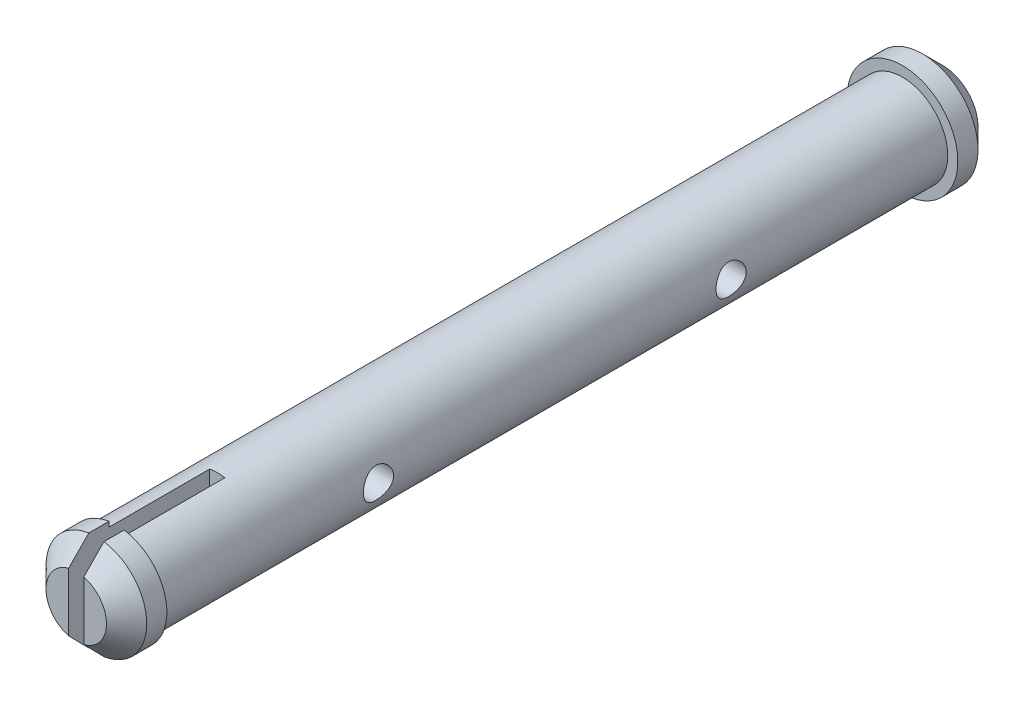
ISO-10303-21;
HEADER;
FILE_DESCRIPTION(('STEP AP214'),'2;1');
FILE_NAME('part.step','',(''),(''),'','','');
FILE_SCHEMA(('AUTOMOTIVE_DESIGN { 1 0 10303 214 1 1 1 1 }'));
ENDSEC;
DATA;
#1=APPLICATION_CONTEXT('core data for automotive mechanical design processes');
#2=APPLICATION_PROTOCOL_DEFINITION('international standard','automotive_design',2000,#1);
#3=PRODUCT_CONTEXT('',#1,'mechanical');
#4=PRODUCT('Part','Part','',(#3));
#5=PRODUCT_RELATED_PRODUCT_CATEGORY('part','',(#4));
#6=PRODUCT_DEFINITION_FORMATION('','',#4);
#7=PRODUCT_DEFINITION_CONTEXT('part definition',#1,'design');
#8=PRODUCT_DEFINITION('design','',#6,#7);
#9=PRODUCT_DEFINITION_SHAPE('','',#8);
#10=(LENGTH_UNIT() NAMED_UNIT(*) SI_UNIT(.MILLI.,.METRE.));
#11=(NAMED_UNIT(*) PLANE_ANGLE_UNIT() SI_UNIT($,.RADIAN.));
#12=(NAMED_UNIT(*) SI_UNIT($,.STERADIAN.) SOLID_ANGLE_UNIT());
#13=UNCERTAINTY_MEASURE_WITH_UNIT(LENGTH_MEASURE(1.E-05),#10,'distance_accuracy_value','');
#14=(GEOMETRIC_REPRESENTATION_CONTEXT(3) GLOBAL_UNCERTAINTY_ASSIGNED_CONTEXT((#13)) GLOBAL_UNIT_ASSIGNED_CONTEXT((#10,
#11,#12)) REPRESENTATION_CONTEXT('',''));
#15=CARTESIAN_POINT('',(0.,0.,0.));
#16=DIRECTION('',(0.,0.,1.));
#17=DIRECTION('',(1.,0.,0.));
#18=AXIS2_PLACEMENT_3D('',#15,#16,#17);
#19=CARTESIAN_POINT('',(0.,0.,82.));
#20=DIRECTION('',(0.,0.,-1.));
#21=DIRECTION('',(-1.,0.,0.));
#22=AXIS2_PLACEMENT_3D('',#19,#20,#21);
#23=CYLINDRICAL_SURFACE('',#22,5.);
#24=DIRECTION('',(0.,0.,-1.));
#25=VECTOR('',#24,1.);
#26=CARTESIAN_POINT('',(-0.749999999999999,-4.9434299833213,82.));
#27=LINE('',#26,#25);
#28=CARTESIAN_POINT('',(-0.749999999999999,-4.9434299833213,78.));
#29=VERTEX_POINT('',#28);
#30=CARTESIAN_POINT('',(-0.749999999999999,-4.9434299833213,80.));
#31=VERTEX_POINT('',#30);
#32=EDGE_CURVE('E162',#29,#31,#27,.F.);
#33=ORIENTED_EDGE('',*,*,#32,.T.);
#34=CARTESIAN_POINT('',(0.,0.,80.));
#35=DIRECTION('',(0.,0.,1.));
#36=DIRECTION('',(1.,0.,0.));
#37=AXIS2_PLACEMENT_3D('',#34,#35,#36);
#38=CIRCLE('',#37,5.);
#39=CARTESIAN_POINT('',(-0.75,4.9434299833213,80.));
#40=VERTEX_POINT('',#39);
#41=EDGE_CURVE('E316',#31,#40,#38,.F.);
#42=ORIENTED_EDGE('',*,*,#41,.T.);
#43=DIRECTION('',(0.,0.,-1.));
#44=VECTOR('',#43,1.);
#45=CARTESIAN_POINT('',(-0.75,4.9434299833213,82.));
#46=LINE('',#45,#44);
#47=CARTESIAN_POINT('',(-0.75,4.9434299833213,78.));
#48=VERTEX_POINT('',#47);
#49=EDGE_CURVE('E175',#40,#48,#46,.T.);
#50=ORIENTED_EDGE('',*,*,#49,.T.);
#51=CARTESIAN_POINT('',(0.,0.,78.));
#52=DIRECTION('',(0.,0.,1.));
#53=DIRECTION('',(1.,0.,0.));
#54=AXIS2_PLACEMENT_3D('',#51,#52,#53);
#55=CIRCLE('',#54,5.);
#56=EDGE_CURVE('E186',#48,#29,#55,.T.);
#57=ORIENTED_EDGE('',*,*,#56,.T.);
#58=EDGE_LOOP('',(#33,#42,#50,#57));
#59=FACE_BOUND('',#58,.T.);
#60=ADVANCED_FACE('F47',(#59),#23,.T.);
#61=CARTESIAN_POINT('',(0.,0.,82.));
#62=DIRECTION('',(0.,0.,1.));
#63=DIRECTION('',(1.,0.,0.));
#64=AXIS2_PLACEMENT_3D('',#61,#62,#63);
#65=PLANE('',#64);
#66=DIRECTION('',(0.,-1.,0.));
#67=VECTOR('',#66,1.);
#68=CARTESIAN_POINT('',(-0.75,5.11707389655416,82.));
#69=LINE('',#68,#67);
#70=CARTESIAN_POINT('',(-0.75,2.90473750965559,82.));
#71=VERTEX_POINT('',#70);
#72=CARTESIAN_POINT('',(-0.749999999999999,-2.90473750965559,82.));
#73=VERTEX_POINT('',#72);
#74=EDGE_CURVE('E347',#71,#73,#69,.T.);
#75=ORIENTED_EDGE('',*,*,#74,.F.);
#76=CARTESIAN_POINT('',(0.,0.,82.));
#77=DIRECTION('',(0.,0.,1.));
#78=DIRECTION('',(1.,0.,0.));
#79=AXIS2_PLACEMENT_3D('',#76,#77,#78);
#80=CIRCLE('',#79,3.00000000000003);
#81=EDGE_CURVE('E215',#71,#73,#80,.T.);
#82=ORIENTED_EDGE('',*,*,#81,.T.);
#83=EDGE_LOOP('',(#75,#82));
#84=FACE_BOUND('',#83,.T.);
#85=ADVANCED_FACE('F252',(#84),#65,.T.);
#86=CARTESIAN_POINT('',(0.,0.,78.));
#87=DIRECTION('',(0.,0.,1.));
#88=DIRECTION('',(1.,0.,0.));
#89=AXIS2_PLACEMENT_3D('',#86,#87,#88);
#90=PLANE('',#89);
#91=ORIENTED_EDGE('',*,*,#56,.F.);
#92=DIRECTION('',(0.,-1.,0.));
#93=VECTOR('',#92,1.);
#94=CARTESIAN_POINT('',(-0.749999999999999,0.,78.));
#95=LINE('',#94,#93);
#96=CARTESIAN_POINT('',(-0.75,4.43705983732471,78.));
#97=VERTEX_POINT('',#96);
#98=EDGE_CURVE('E144',#48,#97,#95,.T.);
#99=ORIENTED_EDGE('',*,*,#98,.T.);
#100=CARTESIAN_POINT('',(0.,0.,78.));
#101=DIRECTION('',(0.,0.,1.));
#102=DIRECTION('',(1.,0.,0.));
#103=AXIS2_PLACEMENT_3D('',#100,#101,#102);
#104=CIRCLE('',#103,4.5);
#105=CARTESIAN_POINT('',(-0.749999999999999,-4.43705983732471,78.));
#106=VERTEX_POINT('',#105);
#107=EDGE_CURVE('E194',#97,#106,#104,.T.);
#108=ORIENTED_EDGE('',*,*,#107,.T.);
#109=EDGE_CURVE('E203',#106,#29,#95,.T.);
#110=ORIENTED_EDGE('',*,*,#109,.T.);
#111=EDGE_LOOP('',(#91,#99,#108,#110));
#112=FACE_BOUND('',#111,.T.);
#113=ADVANCED_FACE('F256',(#112),#90,.F.);
#114=CARTESIAN_POINT('',(0.,0.,78.));
#115=DIRECTION('',(0.,0.,-1.));
#116=DIRECTION('',(-1.,0.,0.));
#117=AXIS2_PLACEMENT_3D('',#114,#115,#116);
#118=CYLINDRICAL_SURFACE('',#117,4.5);
#119=CARTESIAN_POINT('',(-4.5,0.,23.));
#120=CARTESIAN_POINT('',(-4.50000022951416,-0.0818450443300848,23.0000003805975));
#121=CARTESIAN_POINT('',(-4.49774654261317,-0.163687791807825,22.9932796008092));
#122=CARTESIAN_POINT('',(-4.48897815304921,-0.324962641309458,22.9666563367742));
#123=CARTESIAN_POINT('',(-4.48246300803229,-0.404394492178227,22.9467524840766));
#124=CARTESIAN_POINT('',(-4.46587961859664,-0.558499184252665,22.8945211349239));
#125=CARTESIAN_POINT('',(-4.4558173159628,-0.633179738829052,22.8622144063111));
#126=CARTESIAN_POINT('',(-4.43316668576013,-0.776062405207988,22.7861882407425));
#127=CARTESIAN_POINT('',(-4.42057786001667,-0.844263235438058,22.7424665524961));
#128=CARTESIAN_POINT('',(-4.39371141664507,-0.974612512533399,22.6432612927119));
#129=CARTESIAN_POINT('',(-4.37939334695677,-1.03650555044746,22.5874531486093));
#130=CARTESIAN_POINT('',(-4.35090472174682,-1.15024903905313,22.4663492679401));
#131=CARTESIAN_POINT('',(-4.33673419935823,-1.20209727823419,22.4010514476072));
#132=CARTESIAN_POINT('',(-4.30969998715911,-1.29573741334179,22.2605223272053));
#133=CARTESIAN_POINT('',(-4.29688558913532,-1.33719728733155,22.1850593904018));
#134=CARTESIAN_POINT('',(-4.27462958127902,-1.40672831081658,22.0277358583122));
#135=CARTESIAN_POINT('',(-4.26518694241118,-1.43480354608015,21.9458772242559));
#136=CARTESIAN_POINT('',(-4.25116954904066,-1.47581019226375,21.7809901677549));
#137=CARTESIAN_POINT('',(-4.24644143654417,-1.48922017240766,21.6980941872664));
#138=CARTESIAN_POINT('',(-4.24193484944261,-1.50201168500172,21.5311043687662));
#139=CARTESIAN_POINT('',(-4.24215484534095,-1.50139755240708,21.4470109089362));
#140=CARTESIAN_POINT('',(-4.2473852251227,-1.48652985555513,21.284095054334));
#141=CARTESIAN_POINT('',(-4.25217623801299,-1.47290086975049,21.2052073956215));
#142=CARTESIAN_POINT('',(-4.26564986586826,-1.43340924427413,21.0509098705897));
#143=CARTESIAN_POINT('',(-4.27433294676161,-1.40754513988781,20.9755004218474));
#144=CARTESIAN_POINT('',(-4.29476866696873,-1.34390858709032,20.8288808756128));
#145=CARTESIAN_POINT('',(-4.30656848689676,-1.30595107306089,20.7577579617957));
#146=CARTESIAN_POINT('',(-4.3318883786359,-1.21933365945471,20.6226936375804));
#147=CARTESIAN_POINT('',(-4.34540894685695,-1.17067066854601,20.5587543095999));
#148=CARTESIAN_POINT('',(-4.37350993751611,-1.06102399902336,20.4363626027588));
#149=CARTESIAN_POINT('',(-4.38810884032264,-0.999529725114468,20.3783709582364));
#150=CARTESIAN_POINT('',(-4.41610407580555,-0.867509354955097,20.2734031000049));
#151=CARTESIAN_POINT('',(-4.42950029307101,-0.796982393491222,20.2264279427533));
#152=CARTESIAN_POINT('',(-4.4537566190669,-0.647921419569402,20.1444555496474));
#153=CARTESIAN_POINT('',(-4.46459025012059,-0.569314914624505,20.1095817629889));
#154=CARTESIAN_POINT('',(-4.48230850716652,-0.406903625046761,20.0536952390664));
#155=CARTESIAN_POINT('',(-4.48919450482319,-0.32310065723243,20.0326776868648));
#156=CARTESIAN_POINT('',(-4.49801440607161,-0.156575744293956,20.0059165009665));
#157=CARTESIAN_POINT('',(-4.50015002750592,-0.0739643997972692,19.9995502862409));
#158=CARTESIAN_POINT('',(-4.49983354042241,0.0911626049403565,20.0004990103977));
#159=CARTESIAN_POINT('',(-4.49738220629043,0.173678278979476,20.0078116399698));
#160=CARTESIAN_POINT('',(-4.48830037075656,0.333779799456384,20.0354178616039));
#161=CARTESIAN_POINT('',(-4.48179298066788,0.411439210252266,20.0553293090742));
#162=CARTESIAN_POINT('',(-4.46537770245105,0.562283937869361,20.1070901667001));
#163=CARTESIAN_POINT('',(-4.45546938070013,0.63546868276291,20.1389410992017));
#164=CARTESIAN_POINT('',(-4.43293396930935,0.777432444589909,20.2146056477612));
#165=CARTESIAN_POINT('',(-4.42024222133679,0.846044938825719,20.2587118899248));
#166=CARTESIAN_POINT('',(-4.39357880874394,0.975097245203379,20.3572912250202));
#167=CARTESIAN_POINT('',(-4.37960675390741,1.03553455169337,20.4117674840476));
#168=CARTESIAN_POINT('',(-4.35115271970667,1.14937876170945,20.5324681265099));
#169=CARTESIAN_POINT('',(-4.33667641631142,1.20234145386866,20.5991138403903));
#170=CARTESIAN_POINT('',(-4.30949959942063,1.29638628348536,20.7406573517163));
#171=CARTESIAN_POINT('',(-4.29679910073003,1.33746832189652,20.8155552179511));
#172=CARTESIAN_POINT('',(-4.27473587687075,1.40639539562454,20.9715095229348));
#173=CARTESIAN_POINT('',(-4.26536641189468,1.43426719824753,21.0525531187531));
#174=CARTESIAN_POINT('',(-4.25116248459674,1.47584200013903,21.2185679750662));
#175=CARTESIAN_POINT('',(-4.24632597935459,1.48955138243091,21.3035374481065));
#176=CARTESIAN_POINT('',(-4.24196788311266,1.50191442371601,21.4702956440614));
#177=CARTESIAN_POINT('',(-4.24218600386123,1.5013053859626,21.5520235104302));
#178=CARTESIAN_POINT('',(-4.24726904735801,1.48686344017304,21.7141476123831));
#179=CARTESIAN_POINT('',(-4.25213369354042,1.47303131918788,21.7945439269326));
#180=CARTESIAN_POINT('',(-4.26576786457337,1.43305771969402,21.9502034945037));
#181=CARTESIAN_POINT('',(-4.27446147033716,1.40715501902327,22.0255352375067));
#182=CARTESIAN_POINT('',(-4.29474598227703,1.34396904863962,22.1708411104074));
#183=CARTESIAN_POINT('',(-4.3063375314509,1.30668325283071,22.240814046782));
#184=CARTESIAN_POINT('',(-4.33174243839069,1.21989103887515,22.3767255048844));
#185=CARTESIAN_POINT('',(-4.34563067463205,1.16992236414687,22.4423547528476));
#186=CARTESIAN_POINT('',(-4.37375034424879,1.05996432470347,22.5645347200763));
#187=CARTESIAN_POINT('',(-4.38798187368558,0.999972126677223,22.6210828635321));
#188=CARTESIAN_POINT('',(-4.41585045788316,0.868862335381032,22.7257166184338));
#189=CARTESIAN_POINT('',(-4.42944272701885,0.797402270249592,22.7733865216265));
#190=CARTESIAN_POINT('',(-4.45388986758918,0.647036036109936,22.855985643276));
#191=CARTESIAN_POINT('',(-4.46474543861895,0.568131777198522,22.8909181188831));
#192=CARTESIAN_POINT('',(-4.48208272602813,0.408740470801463,22.945582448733));
#193=CARTESIAN_POINT('',(-4.48873818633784,0.328481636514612,22.9659236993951));
#194=CARTESIAN_POINT('',(-4.49769610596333,0.16548062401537,22.9931304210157));
#195=CARTESIAN_POINT('',(-4.49999976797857,0.0827391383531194,22.9999996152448));
#196=CARTESIAN_POINT('',(-4.5,0.,23.));
#197=B_SPLINE_CURVE_WITH_KNOTS('',3,(#119,#120,#121,#122,#123,#124,#125,#126,#127,#128,#129,
#130,#131,#132,#133,#134,#135,#136,#137,#138,#139,#140,#141,#142,#143,#144,#145,#146,#147,#148,
#149,#150,#151,#152,#153,#154,#155,#156,#157,#158,#159,#160,#161,#162,#163,#164,#165,#166,#167,
#168,#169,#170,#171,#172,#173,#174,#175,#176,#177,#178,#179,#180,#181,#182,#183,#184,#185,#186,
#187,#188,#189,#190,#191,#192,#193,#194,#195,#196),.UNSPECIFIED.,.T.,.F.,(4,2,2,2,2,2,2,2,2,2,2,
2,2,2,2,2,2,2,2,2,2,2,2,2,2,2,2,2,2,2,2,2,2,2,2,2,2,2,4),(0.,0.245230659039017,
0.490486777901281,0.735334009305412,0.98022956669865,1.23277026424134,1.48536649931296,
1.74522577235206,2.0050056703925,2.2560288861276,2.50697450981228,2.74645239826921,
2.98595896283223,3.22932256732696,3.47275653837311,3.7288995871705,3.98506718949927,
4.24377608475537,4.50239503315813,4.74980374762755,4.99717069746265,5.2373723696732,
5.47760467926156,5.72415599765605,5.97078271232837,6.22861534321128,6.48645012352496,
6.74376020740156,7.00095427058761,7.24493499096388,7.48890119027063,7.72823380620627,
7.96761957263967,8.21745100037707,8.46735316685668,8.72699491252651,8.98657021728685,
9.23454837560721,9.4824579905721),.UNSPECIFIED.);
#198=CARTESIAN_POINT('',(-4.5,0.,23.));
#199=VERTEX_POINT('',#198);
#200=EDGE_CURVE('E53',#199,#199,#197,.T.);
#201=ORIENTED_EDGE('',*,*,#200,.T.);
#202=EDGE_LOOP('',(#201));
#203=FACE_BOUND('',#202,.T.);
#204=CARTESIAN_POINT('',(4.5,0.,20.));
#205=CARTESIAN_POINT('',(4.50000022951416,-0.0818450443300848,19.9999996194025));
#206=CARTESIAN_POINT('',(4.49774654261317,-0.163687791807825,20.0067203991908));
#207=CARTESIAN_POINT('',(4.48897815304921,-0.324962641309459,20.0333436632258));
#208=CARTESIAN_POINT('',(4.48246300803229,-0.404394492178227,20.0532475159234));
#209=CARTESIAN_POINT('',(4.46587961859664,-0.558499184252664,20.1054788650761));
#210=CARTESIAN_POINT('',(4.4558173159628,-0.633179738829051,20.1377855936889));
#211=CARTESIAN_POINT('',(4.43316668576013,-0.776062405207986,20.2138117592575));
#212=CARTESIAN_POINT('',(4.42057786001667,-0.844263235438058,20.2575334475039));
#213=CARTESIAN_POINT('',(4.39371141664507,-0.974612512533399,20.3567387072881));
#214=CARTESIAN_POINT('',(4.37939334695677,-1.03650555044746,20.4125468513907));
#215=CARTESIAN_POINT('',(4.35090472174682,-1.15024903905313,20.5336507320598));
#216=CARTESIAN_POINT('',(4.33673419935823,-1.20209727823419,20.5989485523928));
#217=CARTESIAN_POINT('',(4.30969998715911,-1.29573741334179,20.7394776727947));
#218=CARTESIAN_POINT('',(4.29688558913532,-1.33719728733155,20.8149406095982));
#219=CARTESIAN_POINT('',(4.27462958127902,-1.40672831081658,20.9722641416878));
#220=CARTESIAN_POINT('',(4.26518694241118,-1.43480354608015,21.0541227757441));
#221=CARTESIAN_POINT('',(4.25116954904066,-1.47581019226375,21.2190098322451));
#222=CARTESIAN_POINT('',(4.24644143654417,-1.48922017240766,21.3019058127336));
#223=CARTESIAN_POINT('',(4.24193484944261,-1.50201168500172,21.4688956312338));
#224=CARTESIAN_POINT('',(4.24215484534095,-1.50139755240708,21.5529890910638));
#225=CARTESIAN_POINT('',(4.2473852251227,-1.48652985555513,21.715904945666));
#226=CARTESIAN_POINT('',(4.25217623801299,-1.47290086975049,21.7947926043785));
#227=CARTESIAN_POINT('',(4.26564986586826,-1.43340924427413,21.9490901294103));
#228=CARTESIAN_POINT('',(4.27433294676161,-1.40754513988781,22.0244995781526));
#229=CARTESIAN_POINT('',(4.29476866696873,-1.34390858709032,22.1711191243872));
#230=CARTESIAN_POINT('',(4.30656848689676,-1.30595107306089,22.2422420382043));
#231=CARTESIAN_POINT('',(4.3318883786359,-1.21933365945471,22.3773063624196));
#232=CARTESIAN_POINT('',(4.34540894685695,-1.17067066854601,22.4412456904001));
#233=CARTESIAN_POINT('',(4.37350993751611,-1.06102399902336,22.5636373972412));
#234=CARTESIAN_POINT('',(4.38810884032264,-0.999529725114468,22.6216290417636));
#235=CARTESIAN_POINT('',(4.41610407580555,-0.867509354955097,22.7265968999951));
#236=CARTESIAN_POINT('',(4.42950029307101,-0.796982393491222,22.7735720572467));
#237=CARTESIAN_POINT('',(4.4537566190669,-0.647921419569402,22.8555444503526));
#238=CARTESIAN_POINT('',(4.46459025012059,-0.569314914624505,22.8904182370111));
#239=CARTESIAN_POINT('',(4.48230850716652,-0.406903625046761,22.9463047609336));
#240=CARTESIAN_POINT('',(4.48919450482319,-0.32310065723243,22.9673223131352));
#241=CARTESIAN_POINT('',(4.49801440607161,-0.156575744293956,22.9940834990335));
#242=CARTESIAN_POINT('',(4.50015002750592,-0.0739643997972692,23.0004497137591));
#243=CARTESIAN_POINT('',(4.49983354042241,0.0911626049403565,22.9995009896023));
#244=CARTESIAN_POINT('',(4.49738220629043,0.173678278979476,22.9921883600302));
#245=CARTESIAN_POINT('',(4.48830037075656,0.333779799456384,22.9645821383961));
#246=CARTESIAN_POINT('',(4.48179298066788,0.411439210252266,22.9446706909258));
#247=CARTESIAN_POINT('',(4.46537770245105,0.562283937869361,22.8929098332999));
#248=CARTESIAN_POINT('',(4.45546938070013,0.63546868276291,22.8610589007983));
#249=CARTESIAN_POINT('',(4.43293396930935,0.777432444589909,22.7853943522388));
#250=CARTESIAN_POINT('',(4.42024222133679,0.846044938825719,22.7412881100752));
#251=CARTESIAN_POINT('',(4.39357880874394,0.975097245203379,22.6427087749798));
#252=CARTESIAN_POINT('',(4.37960675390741,1.03553455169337,22.5882325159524));
#253=CARTESIAN_POINT('',(4.35115271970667,1.14937876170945,22.4675318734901));
#254=CARTESIAN_POINT('',(4.33667641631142,1.20234145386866,22.4008861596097));
#255=CARTESIAN_POINT('',(4.30949959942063,1.29638628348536,22.2593426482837));
#256=CARTESIAN_POINT('',(4.29679910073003,1.33746832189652,22.1844447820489));
#257=CARTESIAN_POINT('',(4.27473587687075,1.40639539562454,22.0284904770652));
#258=CARTESIAN_POINT('',(4.26536641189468,1.43426719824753,21.9474468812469));
#259=CARTESIAN_POINT('',(4.25116248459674,1.47584200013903,21.7814320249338));
#260=CARTESIAN_POINT('',(4.24632597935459,1.48955138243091,21.6964625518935));
#261=CARTESIAN_POINT('',(4.24196788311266,1.50191442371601,21.5297043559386));
#262=CARTESIAN_POINT('',(4.24218600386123,1.5013053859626,21.4479764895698));
#263=CARTESIAN_POINT('',(4.24726904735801,1.48686344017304,21.2858523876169));
#264=CARTESIAN_POINT('',(4.25213369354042,1.47303131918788,21.2054560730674));
#265=CARTESIAN_POINT('',(4.26576786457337,1.43305771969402,21.0497965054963));
#266=CARTESIAN_POINT('',(4.27446147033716,1.40715501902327,20.9744647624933));
#267=CARTESIAN_POINT('',(4.29474598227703,1.34396904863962,20.8291588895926));
#268=CARTESIAN_POINT('',(4.3063375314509,1.30668325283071,20.759185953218));
#269=CARTESIAN_POINT('',(4.33174243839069,1.21989103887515,20.6232744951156));
#270=CARTESIAN_POINT('',(4.34563067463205,1.16992236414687,20.5576452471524));
#271=CARTESIAN_POINT('',(4.37375034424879,1.05996432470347,20.4354652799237));
#272=CARTESIAN_POINT('',(4.38798187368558,0.999972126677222,20.3789171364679));
#273=CARTESIAN_POINT('',(4.41585045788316,0.868862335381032,20.2742833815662));
#274=CARTESIAN_POINT('',(4.42944272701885,0.797402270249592,20.2266134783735));
#275=CARTESIAN_POINT('',(4.45388986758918,0.647036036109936,20.144014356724));
#276=CARTESIAN_POINT('',(4.46474543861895,0.568131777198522,20.1090818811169));
#277=CARTESIAN_POINT('',(4.48208272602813,0.408740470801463,20.054417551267));
#278=CARTESIAN_POINT('',(4.48873818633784,0.328481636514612,20.0340763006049));
#279=CARTESIAN_POINT('',(4.49769610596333,0.16548062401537,20.0068695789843));
#280=CARTESIAN_POINT('',(4.49999976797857,0.0827391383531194,20.0000003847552));
#281=CARTESIAN_POINT('',(4.5,0.,20.));
#282=B_SPLINE_CURVE_WITH_KNOTS('',3,(#204,#205,#206,#207,#208,#209,#210,#211,#212,#213,#214,
#215,#216,#217,#218,#219,#220,#221,#222,#223,#224,#225,#226,#227,#228,#229,#230,#231,#232,#233,
#234,#235,#236,#237,#238,#239,#240,#241,#242,#243,#244,#245,#246,#247,#248,#249,#250,#251,#252,
#253,#254,#255,#256,#257,#258,#259,#260,#261,#262,#263,#264,#265,#266,#267,#268,#269,#270,#271,
#272,#273,#274,#275,#276,#277,#278,#279,#280,#281),.UNSPECIFIED.,.T.,.F.,(4,2,2,2,2,2,2,2,2,2,2,
2,2,2,2,2,2,2,2,2,2,2,2,2,2,2,2,2,2,2,2,2,2,2,2,2,2,2,4),(0.,0.245230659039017,
0.490486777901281,0.735334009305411,0.98022956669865,1.23277026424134,1.48536649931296,
1.74522577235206,2.0050056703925,2.2560288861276,2.50697450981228,2.74645239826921,
2.98595896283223,3.22932256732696,3.47275653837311,3.7288995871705,3.98506718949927,
4.24377608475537,4.50239503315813,4.74980374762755,4.99717069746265,5.2373723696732,
5.47760467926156,5.72415599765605,5.97078271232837,6.22861534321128,6.48645012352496,
6.74376020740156,7.00095427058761,7.24493499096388,7.48890119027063,7.72823380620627,
7.96761957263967,8.21745100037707,8.46735316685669,8.72699491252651,8.98657021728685,
9.23454837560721,9.4824579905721),.UNSPECIFIED.);
#283=CARTESIAN_POINT('',(4.5,0.,20.));
#284=VERTEX_POINT('',#283);
#285=EDGE_CURVE('E289',#284,#284,#282,.T.);
#286=ORIENTED_EDGE('',*,*,#285,.T.);
#287=EDGE_LOOP('',(#286));
#288=FACE_BOUND('',#287,.T.);
#289=CARTESIAN_POINT('',(-4.5,0.,58.));
#290=CARTESIAN_POINT('',(-4.50000022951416,-0.0818450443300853,58.0000003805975));
#291=CARTESIAN_POINT('',(-4.49774654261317,-0.163687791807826,57.9932796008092));
#292=CARTESIAN_POINT('',(-4.48897815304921,-0.324962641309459,57.9666563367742));
#293=CARTESIAN_POINT('',(-4.48246300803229,-0.404394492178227,57.9467524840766));
#294=CARTESIAN_POINT('',(-4.46587961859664,-0.558499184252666,57.8945211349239));
#295=CARTESIAN_POINT('',(-4.4558173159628,-0.633179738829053,57.8622144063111));
#296=CARTESIAN_POINT('',(-4.43316668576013,-0.776062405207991,57.7861882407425));
#297=CARTESIAN_POINT('',(-4.42057786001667,-0.844263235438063,57.7424665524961));
#298=CARTESIAN_POINT('',(-4.39371141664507,-0.974612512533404,57.6432612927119));
#299=CARTESIAN_POINT('',(-4.37939334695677,-1.03650555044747,57.5874531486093));
#300=CARTESIAN_POINT('',(-4.35090472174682,-1.15024903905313,57.4663492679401));
#301=CARTESIAN_POINT('',(-4.33673419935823,-1.2020972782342,57.4010514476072));
#302=CARTESIAN_POINT('',(-4.3096999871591,-1.29573741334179,57.2605223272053));
#303=CARTESIAN_POINT('',(-4.29688558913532,-1.33719728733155,57.1850593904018));
#304=CARTESIAN_POINT('',(-4.27462958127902,-1.40672831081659,57.0277358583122));
#305=CARTESIAN_POINT('',(-4.26518694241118,-1.43480354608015,56.9458772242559));
#306=CARTESIAN_POINT('',(-4.25116954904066,-1.47581019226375,56.7809901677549));
#307=CARTESIAN_POINT('',(-4.24644143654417,-1.48922017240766,56.6980941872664));
#308=CARTESIAN_POINT('',(-4.24193484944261,-1.50201168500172,56.5311043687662));
#309=CARTESIAN_POINT('',(-4.24215484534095,-1.50139755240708,56.4470109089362));
#310=CARTESIAN_POINT('',(-4.2473852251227,-1.48652985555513,56.284095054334));
#311=CARTESIAN_POINT('',(-4.25217623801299,-1.47290086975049,56.2052073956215));
#312=CARTESIAN_POINT('',(-4.26564986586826,-1.43340924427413,56.0509098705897));
#313=CARTESIAN_POINT('',(-4.27433294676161,-1.40754513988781,55.9755004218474));
#314=CARTESIAN_POINT('',(-4.29476866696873,-1.34390858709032,55.8288808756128));
#315=CARTESIAN_POINT('',(-4.30656848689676,-1.30595107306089,55.7577579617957));
#316=CARTESIAN_POINT('',(-4.3318883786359,-1.21933365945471,55.6226936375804));
#317=CARTESIAN_POINT('',(-4.34540894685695,-1.17067066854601,55.5587543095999));
#318=CARTESIAN_POINT('',(-4.37350993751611,-1.06102399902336,55.4363626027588));
#319=CARTESIAN_POINT('',(-4.38810884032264,-0.999529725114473,55.3783709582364));
#320=CARTESIAN_POINT('',(-4.41610407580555,-0.867509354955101,55.2734031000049));
#321=CARTESIAN_POINT('',(-4.42950029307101,-0.796982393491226,55.2264279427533));
#322=CARTESIAN_POINT('',(-4.4537566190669,-0.647921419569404,55.1444555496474));
#323=CARTESIAN_POINT('',(-4.46459025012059,-0.569314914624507,55.1095817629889));
#324=CARTESIAN_POINT('',(-4.48230850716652,-0.406903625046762,55.0536952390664));
#325=CARTESIAN_POINT('',(-4.48919450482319,-0.32310065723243,55.0326776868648));
#326=CARTESIAN_POINT('',(-4.49801440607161,-0.156575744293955,55.0059165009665));
#327=CARTESIAN_POINT('',(-4.50015002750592,-0.0739643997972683,54.9995502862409));
#328=CARTESIAN_POINT('',(-4.49983354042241,0.0911626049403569,55.0004990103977));
#329=CARTESIAN_POINT('',(-4.49738220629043,0.173678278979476,55.0078116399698));
#330=CARTESIAN_POINT('',(-4.48830037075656,0.333779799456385,55.0354178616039));
#331=CARTESIAN_POINT('',(-4.48179298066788,0.411439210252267,55.0553293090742));
#332=CARTESIAN_POINT('',(-4.46537770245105,0.562283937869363,55.1070901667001));
#333=CARTESIAN_POINT('',(-4.45546938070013,0.635468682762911,55.1389410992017));
#334=CARTESIAN_POINT('',(-4.43293396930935,0.777432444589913,55.2146056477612));
#335=CARTESIAN_POINT('',(-4.42024222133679,0.846044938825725,55.2587118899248));
#336=CARTESIAN_POINT('',(-4.39357880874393,0.975097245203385,55.3572912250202));
#337=CARTESIAN_POINT('',(-4.37960675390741,1.03553455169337,55.4117674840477));
#338=CARTESIAN_POINT('',(-4.35115271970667,1.14937876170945,55.5324681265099));
#339=CARTESIAN_POINT('',(-4.33667641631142,1.20234145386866,55.5991138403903));
#340=CARTESIAN_POINT('',(-4.30949959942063,1.29638628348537,55.7406573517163));
#341=CARTESIAN_POINT('',(-4.29679910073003,1.33746832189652,55.8155552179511));
#342=CARTESIAN_POINT('',(-4.27473587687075,1.40639539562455,55.9715095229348));
#343=CARTESIAN_POINT('',(-4.26536641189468,1.43426719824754,56.0525531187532));
#344=CARTESIAN_POINT('',(-4.25116248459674,1.47584200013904,56.2185679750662));
#345=CARTESIAN_POINT('',(-4.24632597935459,1.48955138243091,56.3035374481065));
#346=CARTESIAN_POINT('',(-4.24196788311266,1.50191442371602,56.4702956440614));
#347=CARTESIAN_POINT('',(-4.24218600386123,1.5013053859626,56.5520235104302));
#348=CARTESIAN_POINT('',(-4.24726904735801,1.48686344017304,56.7141476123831));
#349=CARTESIAN_POINT('',(-4.25213369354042,1.47303131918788,56.7945439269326));
#350=CARTESIAN_POINT('',(-4.26576786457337,1.43305771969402,56.9502034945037));
#351=CARTESIAN_POINT('',(-4.27446147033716,1.40715501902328,57.0255352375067));
#352=CARTESIAN_POINT('',(-4.29474598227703,1.34396904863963,57.1708411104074));
#353=CARTESIAN_POINT('',(-4.30633753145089,1.30668325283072,57.240814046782));
#354=CARTESIAN_POINT('',(-4.33174243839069,1.21989103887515,57.3767255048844));
#355=CARTESIAN_POINT('',(-4.34563067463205,1.16992236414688,57.4423547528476));
#356=CARTESIAN_POINT('',(-4.37375034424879,1.05996432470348,57.5645347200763));
#357=CARTESIAN_POINT('',(-4.38798187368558,0.999972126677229,57.6210828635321));
#358=CARTESIAN_POINT('',(-4.41585045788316,0.868862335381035,57.7257166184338));
#359=CARTESIAN_POINT('',(-4.42944272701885,0.797402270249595,57.7733865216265));
#360=CARTESIAN_POINT('',(-4.45388986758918,0.647036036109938,57.855985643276));
#361=CARTESIAN_POINT('',(-4.46474543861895,0.568131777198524,57.8909181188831));
#362=CARTESIAN_POINT('',(-4.48208272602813,0.408740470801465,57.945582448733));
#363=CARTESIAN_POINT('',(-4.48873818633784,0.328481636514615,57.9659236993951));
#364=CARTESIAN_POINT('',(-4.49769610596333,0.165480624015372,57.9931304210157));
#365=CARTESIAN_POINT('',(-4.49999976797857,0.0827391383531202,57.9999996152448));
#366=CARTESIAN_POINT('',(-4.5,0.,58.));
#367=B_SPLINE_CURVE_WITH_KNOTS('',3,(#289,#290,#291,#292,#293,#294,#295,#296,#297,#298,#299,
#300,#301,#302,#303,#304,#305,#306,#307,#308,#309,#310,#311,#312,#313,#314,#315,#316,#317,#318,
#319,#320,#321,#322,#323,#324,#325,#326,#327,#328,#329,#330,#331,#332,#333,#334,#335,#336,#337,
#338,#339,#340,#341,#342,#343,#344,#345,#346,#347,#348,#349,#350,#351,#352,#353,#354,#355,#356,
#357,#358,#359,#360,#361,#362,#363,#364,#365,#366),.UNSPECIFIED.,.T.,.F.,(4,2,2,2,2,2,2,2,2,2,2,
2,2,2,2,2,2,2,2,2,2,2,2,2,2,2,2,2,2,2,2,2,2,2,2,2,2,2,4),(0.,0.245230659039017,
0.490486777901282,0.735334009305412,0.980229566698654,1.23277026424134,1.48536649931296,
1.74522577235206,2.0050056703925,2.2560288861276,2.50697450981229,2.74645239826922,
2.98595896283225,3.22932256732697,3.47275653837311,3.72889958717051,3.98506718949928,
4.24377608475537,4.50239503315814,4.74980374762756,4.99717069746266,5.23737236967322,
5.47760467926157,5.72415599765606,5.97078271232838,6.22861534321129,6.48645012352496,
6.74376020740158,7.00095427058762,7.24493499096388,7.48890119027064,7.72823380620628,
7.96761957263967,8.21745100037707,8.4673531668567,8.72699491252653,8.98657021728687,
9.23454837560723,9.48245799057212),.UNSPECIFIED.);
#368=CARTESIAN_POINT('',(-4.5,0.,58.));
#369=VERTEX_POINT('',#368);
#370=EDGE_CURVE('E285',#369,#369,#367,.T.);
#371=ORIENTED_EDGE('',*,*,#370,.T.);
#372=EDGE_LOOP('',(#371));
#373=FACE_BOUND('',#372,.T.);
#374=CARTESIAN_POINT('',(4.5,0.,55.));
#375=CARTESIAN_POINT('',(4.50000022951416,-0.0818450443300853,54.9999996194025));
#376=CARTESIAN_POINT('',(4.49774654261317,-0.163687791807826,55.0067203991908));
#377=CARTESIAN_POINT('',(4.48897815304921,-0.324962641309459,55.0333436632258));
#378=CARTESIAN_POINT('',(4.48246300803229,-0.404394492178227,55.0532475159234));
#379=CARTESIAN_POINT('',(4.46587961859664,-0.558499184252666,55.1054788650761));
#380=CARTESIAN_POINT('',(4.4558173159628,-0.633179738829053,55.1377855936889));
#381=CARTESIAN_POINT('',(4.43316668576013,-0.776062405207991,55.2138117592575));
#382=CARTESIAN_POINT('',(4.42057786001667,-0.844263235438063,55.2575334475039));
#383=CARTESIAN_POINT('',(4.39371141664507,-0.974612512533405,55.3567387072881));
#384=CARTESIAN_POINT('',(4.37939334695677,-1.03650555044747,55.4125468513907));
#385=CARTESIAN_POINT('',(4.35090472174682,-1.15024903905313,55.5336507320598));
#386=CARTESIAN_POINT('',(4.33673419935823,-1.2020972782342,55.5989485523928));
#387=CARTESIAN_POINT('',(4.3096999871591,-1.29573741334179,55.7394776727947));
#388=CARTESIAN_POINT('',(4.29688558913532,-1.33719728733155,55.8149406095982));
#389=CARTESIAN_POINT('',(4.27462958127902,-1.40672831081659,55.9722641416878));
#390=CARTESIAN_POINT('',(4.26518694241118,-1.43480354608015,56.0541227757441));
#391=CARTESIAN_POINT('',(4.25116954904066,-1.47581019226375,56.2190098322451));
#392=CARTESIAN_POINT('',(4.24644143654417,-1.48922017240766,56.3019058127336));
#393=CARTESIAN_POINT('',(4.24193484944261,-1.50201168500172,56.4688956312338));
#394=CARTESIAN_POINT('',(4.24215484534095,-1.50139755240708,56.5529890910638));
#395=CARTESIAN_POINT('',(4.2473852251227,-1.48652985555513,56.715904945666));
#396=CARTESIAN_POINT('',(4.25217623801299,-1.47290086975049,56.7947926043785));
#397=CARTESIAN_POINT('',(4.26564986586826,-1.43340924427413,56.9490901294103));
#398=CARTESIAN_POINT('',(4.27433294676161,-1.40754513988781,57.0244995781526));
#399=CARTESIAN_POINT('',(4.29476866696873,-1.34390858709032,57.1711191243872));
#400=CARTESIAN_POINT('',(4.30656848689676,-1.30595107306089,57.2422420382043));
#401=CARTESIAN_POINT('',(4.3318883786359,-1.21933365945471,57.3773063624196));
#402=CARTESIAN_POINT('',(4.34540894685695,-1.17067066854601,57.4412456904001));
#403=CARTESIAN_POINT('',(4.37350993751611,-1.06102399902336,57.5636373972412));
#404=CARTESIAN_POINT('',(4.38810884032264,-0.999529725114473,57.6216290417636));
#405=CARTESIAN_POINT('',(4.41610407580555,-0.867509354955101,57.7265968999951));
#406=CARTESIAN_POINT('',(4.42950029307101,-0.796982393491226,57.7735720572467));
#407=CARTESIAN_POINT('',(4.4537566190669,-0.647921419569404,57.8555444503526));
#408=CARTESIAN_POINT('',(4.46459025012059,-0.569314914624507,57.8904182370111));
#409=CARTESIAN_POINT('',(4.48230850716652,-0.406903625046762,57.9463047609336));
#410=CARTESIAN_POINT('',(4.48919450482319,-0.32310065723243,57.9673223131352));
#411=CARTESIAN_POINT('',(4.49801440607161,-0.156575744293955,57.9940834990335));
#412=CARTESIAN_POINT('',(4.50015002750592,-0.0739643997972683,58.0004497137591));
#413=CARTESIAN_POINT('',(4.49983354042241,0.0911626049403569,57.9995009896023));
#414=CARTESIAN_POINT('',(4.49738220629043,0.173678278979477,57.9921883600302));
#415=CARTESIAN_POINT('',(4.48830037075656,0.333779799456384,57.9645821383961));
#416=CARTESIAN_POINT('',(4.48179298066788,0.411439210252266,57.9446706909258));
#417=CARTESIAN_POINT('',(4.46537770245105,0.562283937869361,57.8929098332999));
#418=CARTESIAN_POINT('',(4.45546938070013,0.635468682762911,57.8610589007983));
#419=CARTESIAN_POINT('',(4.43293396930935,0.777432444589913,57.7853943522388));
#420=CARTESIAN_POINT('',(4.42024222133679,0.846044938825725,57.7412881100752));
#421=CARTESIAN_POINT('',(4.39357880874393,0.975097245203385,57.6427087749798));
#422=CARTESIAN_POINT('',(4.37960675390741,1.03553455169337,57.5882325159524));
#423=CARTESIAN_POINT('',(4.35115271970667,1.14937876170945,57.4675318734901));
#424=CARTESIAN_POINT('',(4.33667641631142,1.20234145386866,57.4008861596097));
#425=CARTESIAN_POINT('',(4.30949959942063,1.29638628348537,57.2593426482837));
#426=CARTESIAN_POINT('',(4.29679910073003,1.33746832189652,57.1844447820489));
#427=CARTESIAN_POINT('',(4.27473587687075,1.40639539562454,57.0284904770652));
#428=CARTESIAN_POINT('',(4.26536641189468,1.43426719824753,56.9474468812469));
#429=CARTESIAN_POINT('',(4.25116248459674,1.47584200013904,56.7814320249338));
#430=CARTESIAN_POINT('',(4.24632597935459,1.48955138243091,56.6964625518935));
#431=CARTESIAN_POINT('',(4.24196788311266,1.50191442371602,56.5297043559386));
#432=CARTESIAN_POINT('',(4.24218600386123,1.5013053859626,56.4479764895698));
#433=CARTESIAN_POINT('',(4.24726904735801,1.48686344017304,56.2858523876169));
#434=CARTESIAN_POINT('',(4.25213369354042,1.47303131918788,56.2054560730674));
#435=CARTESIAN_POINT('',(4.26576786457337,1.43305771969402,56.0497965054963));
#436=CARTESIAN_POINT('',(4.27446147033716,1.40715501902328,55.9744647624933));
#437=CARTESIAN_POINT('',(4.29474598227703,1.34396904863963,55.8291588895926));
#438=CARTESIAN_POINT('',(4.30633753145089,1.30668325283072,55.759185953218));
#439=CARTESIAN_POINT('',(4.33174243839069,1.21989103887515,55.6232744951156));
#440=CARTESIAN_POINT('',(4.34563067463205,1.16992236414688,55.5576452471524));
#441=CARTESIAN_POINT('',(4.37375034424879,1.05996432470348,55.4354652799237));
#442=CARTESIAN_POINT('',(4.38798187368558,0.999972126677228,55.3789171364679));
#443=CARTESIAN_POINT('',(4.41585045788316,0.868862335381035,55.2742833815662));
#444=CARTESIAN_POINT('',(4.42944272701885,0.797402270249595,55.2266134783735));
#445=CARTESIAN_POINT('',(4.45388986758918,0.647036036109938,55.144014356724));
#446=CARTESIAN_POINT('',(4.46474543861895,0.568131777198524,55.1090818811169));
#447=CARTESIAN_POINT('',(4.48208272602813,0.408740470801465,55.054417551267));
#448=CARTESIAN_POINT('',(4.48873818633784,0.328481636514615,55.0340763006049));
#449=CARTESIAN_POINT('',(4.49769610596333,0.165480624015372,55.0068695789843));
#450=CARTESIAN_POINT('',(4.49999976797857,0.0827391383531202,55.0000003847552));
#451=CARTESIAN_POINT('',(4.5,0.,55.));
#452=B_SPLINE_CURVE_WITH_KNOTS('',3,(#374,#375,#376,#377,#378,#379,#380,#381,#382,#383,#384,
#385,#386,#387,#388,#389,#390,#391,#392,#393,#394,#395,#396,#397,#398,#399,#400,#401,#402,#403,
#404,#405,#406,#407,#408,#409,#410,#411,#412,#413,#414,#415,#416,#417,#418,#419,#420,#421,#422,
#423,#424,#425,#426,#427,#428,#429,#430,#431,#432,#433,#434,#435,#436,#437,#438,#439,#440,#441,
#442,#443,#444,#445,#446,#447,#448,#449,#450,#451),.UNSPECIFIED.,.T.,.F.,(4,2,2,2,2,2,2,2,2,2,2,
2,2,2,2,2,2,2,2,2,2,2,2,2,2,2,2,2,2,2,2,2,2,2,2,2,2,2,4),(0.,0.245230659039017,
0.490486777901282,0.735334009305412,0.980229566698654,1.23277026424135,1.48536649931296,
1.74522577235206,2.0050056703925,2.2560288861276,2.50697450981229,2.74645239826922,
2.98595896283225,3.22932256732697,3.47275653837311,3.72889958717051,3.98506718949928,
4.24377608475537,4.50239503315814,4.74980374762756,4.99717069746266,5.23737236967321,
5.47760467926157,5.72415599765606,5.97078271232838,6.22861534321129,6.48645012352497,
6.74376020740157,7.00095427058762,7.24493499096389,7.48890119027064,7.72823380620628,
7.96761957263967,8.21745100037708,8.4673531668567,8.72699491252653,8.98657021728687,
9.23454837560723,9.48245799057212),.UNSPECIFIED.);
#453=CARTESIAN_POINT('',(4.5,0.,55.));
#454=VERTEX_POINT('',#453);
#455=EDGE_CURVE('E278',#454,#454,#452,.T.);
#456=ORIENTED_EDGE('',*,*,#455,.T.);
#457=EDGE_LOOP('',(#456));
#458=FACE_BOUND('',#457,.T.);
#459=ORIENTED_EDGE('',*,*,#107,.F.);
#460=DIRECTION('',(0.,0.,-1.));
#461=VECTOR('',#460,1.);
#462=CARTESIAN_POINT('',(-0.75,4.43705983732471,78.));
#463=LINE('',#462,#461);
#464=CARTESIAN_POINT('',(-0.75,4.43705983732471,68.));
#465=VERTEX_POINT('',#464);
#466=EDGE_CURVE('E178',#97,#465,#463,.T.);
#467=ORIENTED_EDGE('',*,*,#466,.T.);
#468=CARTESIAN_POINT('',(0.,0.,68.));
#469=DIRECTION('',(0.,0.,1.));
#470=DIRECTION('',(1.,0.,0.));
#471=AXIS2_PLACEMENT_3D('',#468,#469,#470);
#472=CIRCLE('',#471,4.5);
#473=CARTESIAN_POINT('',(0.75,4.43705983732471,68.));
#474=VERTEX_POINT('',#473);
#475=EDGE_CURVE('E143',#474,#465,#472,.T.);
#476=ORIENTED_EDGE('',*,*,#475,.F.);
#477=DIRECTION('',(0.,0.,-1.));
#478=VECTOR('',#477,1.);
#479=CARTESIAN_POINT('',(0.75,4.43705983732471,78.));
#480=LINE('',#479,#478);
#481=CARTESIAN_POINT('',(0.75,4.43705983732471,78.));
#482=VERTEX_POINT('',#481);
#483=EDGE_CURVE('E151',#474,#482,#480,.F.);
#484=ORIENTED_EDGE('',*,*,#483,.T.);
#485=CARTESIAN_POINT('',(0.749999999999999,-4.43705983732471,78.));
#486=VERTEX_POINT('',#485);
#487=EDGE_CURVE('E160',#486,#482,#104,.T.);
#488=ORIENTED_EDGE('',*,*,#487,.F.);
#489=DIRECTION('',(0.,0.,-1.));
#490=VECTOR('',#489,1.);
#491=CARTESIAN_POINT('',(0.749999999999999,-4.43705983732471,78.));
#492=LINE('',#491,#490);
#493=CARTESIAN_POINT('',(0.749999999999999,-4.43705983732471,68.));
#494=VERTEX_POINT('',#493);
#495=EDGE_CURVE('E148',#486,#494,#492,.T.);
#496=ORIENTED_EDGE('',*,*,#495,.T.);
#497=CARTESIAN_POINT('',(-0.749999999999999,-4.43705983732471,68.));
#498=VERTEX_POINT('',#497);
#499=EDGE_CURVE('E132',#498,#494,#472,.T.);
#500=ORIENTED_EDGE('',*,*,#499,.F.);
#501=DIRECTION('',(0.,0.,-1.));
#502=VECTOR('',#501,1.);
#503=CARTESIAN_POINT('',(-0.749999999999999,-4.43705983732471,78.));
#504=LINE('',#503,#502);
#505=EDGE_CURVE('E168',#498,#106,#504,.F.);
#506=ORIENTED_EDGE('',*,*,#505,.T.);
#507=EDGE_LOOP('',(#459,#467,#476,#484,#488,#496,#500,#506));
#508=FACE_BOUND('',#507,.T.);
#509=CARTESIAN_POINT('',(0.,0.,0.));
#510=DIRECTION('',(0.,0.,1.));
#511=DIRECTION('',(1.,0.,0.));
#512=AXIS2_PLACEMENT_3D('',#509,#510,#511);
#513=CIRCLE('',#512,4.5);
#514=CARTESIAN_POINT('',(4.5,0.,0.));
#515=VERTEX_POINT('',#514);
#516=EDGE_CURVE('E191',#515,#515,#513,.T.);
#517=ORIENTED_EDGE('',*,*,#516,.T.);
#518=EDGE_LOOP('',(#517));
#519=FACE_BOUND('',#518,.T.);
#520=ADVANCED_FACE('F157',(#203,#288,#373,#458,#508,#519),#118,.T.);
#521=CARTESIAN_POINT('',(0.,0.,-4.));
#522=DIRECTION('',(0.,0.,1.));
#523=DIRECTION('',(1.,0.,0.));
#524=AXIS2_PLACEMENT_3D('',#521,#522,#523);
#525=CYLINDRICAL_SURFACE('',#524,5.5);
#526=CARTESIAN_POINT('',(0.,0.,-2.));
#527=DIRECTION('',(0.,0.,-1.));
#528=DIRECTION('',(-1.,0.,0.));
#529=AXIS2_PLACEMENT_3D('',#526,#527,#528);
#530=CIRCLE('',#529,5.5);
#531=CARTESIAN_POINT('',(-5.5,0.,-2.));
#532=VERTEX_POINT('',#531);
#533=EDGE_CURVE('E211',#532,#532,#530,.F.);
#534=ORIENTED_EDGE('',*,*,#533,.T.);
#535=EDGE_LOOP('',(#534));
#536=FACE_BOUND('',#535,.T.);
#537=CARTESIAN_POINT('',(0.,0.,0.));
#538=DIRECTION('',(0.,0.,-1.));
#539=DIRECTION('',(-1.,0.,0.));
#540=AXIS2_PLACEMENT_3D('',#537,#538,#539);
#541=CIRCLE('',#540,5.5);
#542=CARTESIAN_POINT('',(-5.5,0.,0.));
#543=VERTEX_POINT('',#542);
#544=EDGE_CURVE('E187',#543,#543,#541,.T.);
#545=ORIENTED_EDGE('',*,*,#544,.T.);
#546=EDGE_LOOP('',(#545));
#547=FACE_BOUND('',#546,.T.);
#548=ADVANCED_FACE('F263',(#536,#547),#525,.T.);
#549=CARTESIAN_POINT('',(0.,0.,-4.));
#550=DIRECTION('',(0.,0.,-1.));
#551=DIRECTION('',(-1.,0.,0.));
#552=AXIS2_PLACEMENT_3D('',#549,#550,#551);
#553=PLANE('',#552);
#554=CARTESIAN_POINT('',(0.,0.,-4.));
#555=DIRECTION('',(0.,0.,-1.));
#556=DIRECTION('',(-1.,0.,0.));
#557=AXIS2_PLACEMENT_3D('',#554,#555,#556);
#558=CIRCLE('',#557,3.5);
#559=CARTESIAN_POINT('',(-3.5,0.,-4.));
#560=VERTEX_POINT('',#559);
#561=EDGE_CURVE('E207',#560,#560,#558,.T.);
#562=ORIENTED_EDGE('',*,*,#561,.T.);
#563=EDGE_LOOP('',(#562));
#564=FACE_BOUND('',#563,.T.);
#565=ADVANCED_FACE('F260',(#564),#553,.T.);
#566=CARTESIAN_POINT('',(0.,0.,0.));
#567=DIRECTION('',(0.,0.,-1.));
#568=DIRECTION('',(-1.,0.,0.));
#569=AXIS2_PLACEMENT_3D('',#566,#567,#568);
#570=PLANE('',#569);
#571=ORIENTED_EDGE('',*,*,#516,.F.);
#572=EDGE_LOOP('',(#571));
#573=FACE_BOUND('',#572,.T.);
#574=ORIENTED_EDGE('',*,*,#544,.F.);
#575=EDGE_LOOP('',(#574));
#576=FACE_BOUND('',#575,.T.);
#577=ADVANCED_FACE('F259',(#573,#576),#570,.F.);
#578=DIRECTION('',(0.,0.,-1.));
#579=VECTOR('',#578,1.);
#580=CARTESIAN_POINT('',(0.75,4.9434299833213,82.));
#581=LINE('',#580,#579);
#582=CARTESIAN_POINT('',(0.75,4.9434299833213,78.));
#583=VERTEX_POINT('',#582);
#584=CARTESIAN_POINT('',(0.75,4.9434299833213,80.));
#585=VERTEX_POINT('',#584);
#586=EDGE_CURVE('E153',#583,#585,#581,.F.);
#587=ORIENTED_EDGE('',*,*,#586,.T.);
#588=CARTESIAN_POINT('',(0.,0.,80.));
#589=DIRECTION('',(0.,0.,1.));
#590=DIRECTION('',(1.,0.,0.));
#591=AXIS2_PLACEMENT_3D('',#588,#589,#590);
#592=CIRCLE('',#591,5.);
#593=CARTESIAN_POINT('',(0.749999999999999,-4.9434299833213,80.));
#594=VERTEX_POINT('',#593);
#595=EDGE_CURVE('E11',#585,#594,#592,.F.);
#596=ORIENTED_EDGE('',*,*,#595,.T.);
#597=DIRECTION('',(0.,0.,-1.));
#598=VECTOR('',#597,1.);
#599=CARTESIAN_POINT('',(0.749999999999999,-4.9434299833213,82.));
#600=LINE('',#599,#598);
#601=CARTESIAN_POINT('',(0.749999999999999,-4.9434299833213,78.));
#602=VERTEX_POINT('',#601);
#603=EDGE_CURVE('E163',#594,#602,#600,.T.);
#604=ORIENTED_EDGE('',*,*,#603,.T.);
#605=EDGE_CURVE('E182',#602,#583,#55,.T.);
#606=ORIENTED_EDGE('',*,*,#605,.T.);
#607=EDGE_LOOP('',(#587,#596,#604,#606));
#608=FACE_BOUND('',#607,.T.);
#609=ADVANCED_FACE('F250',(#608),#23,.T.);
#610=DIRECTION('',(0.,1.,0.));
#611=VECTOR('',#610,1.);
#612=CARTESIAN_POINT('',(0.75,5.11707389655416,82.));
#613=LINE('',#612,#611);
#614=CARTESIAN_POINT('',(0.749999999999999,-2.90473750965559,82.));
#615=VERTEX_POINT('',#614);
#616=CARTESIAN_POINT('',(0.75,2.90473750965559,82.));
#617=VERTEX_POINT('',#616);
#618=EDGE_CURVE('E343',#615,#617,#613,.T.);
#619=ORIENTED_EDGE('',*,*,#618,.F.);
#620=CARTESIAN_POINT('',(0.,0.,82.));
#621=DIRECTION('',(0.,0.,1.));
#622=DIRECTION('',(1.,0.,0.));
#623=AXIS2_PLACEMENT_3D('',#620,#621,#622);
#624=CIRCLE('',#623,3.00000000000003);
#625=EDGE_CURVE('E323',#615,#617,#624,.T.);
#626=ORIENTED_EDGE('',*,*,#625,.T.);
#627=EDGE_LOOP('',(#619,#626));
#628=FACE_BOUND('',#627,.T.);
#629=ADVANCED_FACE('F245',(#628),#65,.T.);
#630=ORIENTED_EDGE('',*,*,#605,.F.);
#631=DIRECTION('',(0.,1.,0.));
#632=VECTOR('',#631,1.);
#633=CARTESIAN_POINT('',(0.749999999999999,0.,78.));
#634=LINE('',#633,#632);
#635=EDGE_CURVE('E202',#602,#486,#634,.T.);
#636=ORIENTED_EDGE('',*,*,#635,.T.);
#637=ORIENTED_EDGE('',*,*,#487,.T.);
#638=EDGE_CURVE('E198',#482,#583,#634,.T.);
#639=ORIENTED_EDGE('',*,*,#638,.T.);
#640=EDGE_LOOP('',(#630,#636,#637,#639));
#641=FACE_BOUND('',#640,.T.);
#642=ADVANCED_FACE('F249',(#641),#90,.F.);
#643=CARTESIAN_POINT('',(0.,0.,68.));
#644=DIRECTION('',(0.,0.,1.));
#645=DIRECTION('',(1.,0.,0.));
#646=AXIS2_PLACEMENT_3D('',#643,#644,#645);
#647=PLANE('',#646);
#648=ORIENTED_EDGE('',*,*,#475,.T.);
#649=DIRECTION('',(0.,-1.,0.));
#650=VECTOR('',#649,1.);
#651=CARTESIAN_POINT('',(-0.75,5.11707389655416,68.));
#652=LINE('',#651,#650);
#653=EDGE_CURVE('E138',#465,#498,#652,.T.);
#654=ORIENTED_EDGE('',*,*,#653,.T.);
#655=ORIENTED_EDGE('',*,*,#499,.T.);
#656=DIRECTION('',(0.,1.,0.));
#657=VECTOR('',#656,1.);
#658=CARTESIAN_POINT('',(0.75,5.11707389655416,68.));
#659=LINE('',#658,#657);
#660=EDGE_CURVE('E135',#494,#474,#659,.T.);
#661=ORIENTED_EDGE('',*,*,#660,.T.);
#662=EDGE_LOOP('',(#648,#654,#655,#661));
#663=FACE_BOUND('',#662,.T.);
#664=ADVANCED_FACE('F134',(#663),#647,.T.);
#665=CARTESIAN_POINT('',(-0.75,5.11707389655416,68.));
#666=DIRECTION('',(-1.,0.,0.));
#667=DIRECTION('',(0.,-1.,0.));
#668=AXIS2_PLACEMENT_3D('',#665,#666,#667);
#669=PLANE('',#668);
#670=ORIENTED_EDGE('',*,*,#74,.T.);
#671=CARTESIAN_POINT('',(-0.749999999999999,-2.90473750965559,82.));
#672=CARTESIAN_POINT('',(-0.749999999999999,-3.07569200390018,81.8344199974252));
#673=CARTESIAN_POINT('',(-0.749999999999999,-3.24624642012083,81.6684287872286));
#674=CARTESIAN_POINT('',(-0.749999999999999,-3.58677057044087,81.3358495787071));
#675=CARTESIAN_POINT('',(-0.749999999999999,-3.75674030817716,81.1692615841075));
#676=CARTESIAN_POINT('',(-0.749999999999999,-4.09631200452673,80.8357130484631));
#677=CARTESIAN_POINT('',(-0.749999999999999,-4.26591396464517,80.6687525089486));
#678=CARTESIAN_POINT('',(-0.749999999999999,-4.60484930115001,80.3345569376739));
#679=CARTESIAN_POINT('',(-0.749999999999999,-4.77418267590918,80.1673219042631));
#680=CARTESIAN_POINT('',(-0.749999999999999,-4.9434299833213,80.));
#681=B_SPLINE_CURVE_WITH_KNOTS('',3,(#671,#672,#673,#674,#675,#676,#677,#678,#679,#680),
.UNSPECIFIED.,.F.,.F.,(4,2,2,2,4),(0.,0.713985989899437,1.42796753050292,2.14194614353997,
2.8559290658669),.UNSPECIFIED.);
#682=EDGE_CURVE('E227',#73,#31,#681,.T.);
#683=ORIENTED_EDGE('',*,*,#682,.T.);
#684=ORIENTED_EDGE('',*,*,#32,.F.);
#685=ORIENTED_EDGE('',*,*,#109,.F.);
#686=ORIENTED_EDGE('',*,*,#505,.F.);
#687=ORIENTED_EDGE('',*,*,#653,.F.);
#688=ORIENTED_EDGE('',*,*,#466,.F.);
#689=ORIENTED_EDGE('',*,*,#98,.F.);
#690=ORIENTED_EDGE('',*,*,#49,.F.);
#691=CARTESIAN_POINT('',(-0.75,4.9434299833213,80.));
#692=CARTESIAN_POINT('',(-0.75,4.77418267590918,80.1673219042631));
#693=CARTESIAN_POINT('',(-0.75,4.60484930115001,80.3345569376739));
#694=CARTESIAN_POINT('',(-0.75,4.26591396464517,80.6687525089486));
#695=CARTESIAN_POINT('',(-0.75,4.09631200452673,80.8357130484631));
#696=CARTESIAN_POINT('',(-0.75,3.75674030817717,81.1692615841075));
#697=CARTESIAN_POINT('',(-0.75,3.58677057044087,81.3358495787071));
#698=CARTESIAN_POINT('',(-0.75,3.24624642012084,81.6684287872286));
#699=CARTESIAN_POINT('',(-0.75,3.07569200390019,81.8344199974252));
#700=CARTESIAN_POINT('',(-0.75,2.9047375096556,82.));
#701=B_SPLINE_CURVE_WITH_KNOTS('',3,(#691,#692,#693,#694,#695,#696,#697,#698,#699,#700),
.UNSPECIFIED.,.F.,.F.,(4,2,2,2,4),(0.,0.713982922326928,1.42796153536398,2.14194307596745,
2.8559290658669),.UNSPECIFIED.);
#702=EDGE_CURVE('E219',#40,#71,#701,.T.);
#703=ORIENTED_EDGE('',*,*,#702,.T.);
#704=EDGE_LOOP('',(#670,#683,#684,#685,#686,#687,#688,#689,#690,#703));
#705=FACE_BOUND('',#704,.T.);
#706=ADVANCED_FACE('F237',(#705),#669,.F.);
#707=CARTESIAN_POINT('',(0.75,5.11707389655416,68.));
#708=DIRECTION('',(1.,0.,0.));
#709=DIRECTION('',(0.,1.,0.));
#710=AXIS2_PLACEMENT_3D('',#707,#708,#709);
#711=PLANE('',#710);
#712=ORIENTED_EDGE('',*,*,#618,.T.);
#713=CARTESIAN_POINT('',(0.75,2.90473750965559,82.));
#714=CARTESIAN_POINT('',(0.75,3.07569200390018,81.8344199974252));
#715=CARTESIAN_POINT('',(0.75,3.24624642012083,81.6684287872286));
#716=CARTESIAN_POINT('',(0.75,3.58677057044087,81.3358495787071));
#717=CARTESIAN_POINT('',(0.75,3.75674030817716,81.1692615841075));
#718=CARTESIAN_POINT('',(0.75,4.09631200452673,80.8357130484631));
#719=CARTESIAN_POINT('',(0.75,4.26591396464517,80.6687525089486));
#720=CARTESIAN_POINT('',(0.75,4.60484930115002,80.3345569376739));
#721=CARTESIAN_POINT('',(0.75,4.77418267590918,80.1673219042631));
#722=CARTESIAN_POINT('',(0.75,4.9434299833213,80.));
#723=B_SPLINE_CURVE_WITH_KNOTS('',3,(#713,#714,#715,#716,#717,#718,#719,#720,#721,#722),
.UNSPECIFIED.,.F.,.F.,(4,2,2,2,4),(0.,0.713985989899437,1.42796753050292,2.14194614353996,
2.8559290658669),.UNSPECIFIED.);
#724=EDGE_CURVE('E64',#617,#585,#723,.T.);
#725=ORIENTED_EDGE('',*,*,#724,.T.);
#726=ORIENTED_EDGE('',*,*,#586,.F.);
#727=ORIENTED_EDGE('',*,*,#638,.F.);
#728=ORIENTED_EDGE('',*,*,#483,.F.);
#729=ORIENTED_EDGE('',*,*,#660,.F.);
#730=ORIENTED_EDGE('',*,*,#495,.F.);
#731=ORIENTED_EDGE('',*,*,#635,.F.);
#732=ORIENTED_EDGE('',*,*,#603,.F.);
#733=CARTESIAN_POINT('',(0.749999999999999,-4.9434299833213,80.));
#734=CARTESIAN_POINT('',(0.749999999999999,-4.77418267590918,80.1673219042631));
#735=CARTESIAN_POINT('',(0.749999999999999,-4.60484930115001,80.3345569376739));
#736=CARTESIAN_POINT('',(0.749999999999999,-4.26591396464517,80.6687525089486));
#737=CARTESIAN_POINT('',(0.749999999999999,-4.09631200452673,80.8357130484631));
#738=CARTESIAN_POINT('',(0.749999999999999,-3.75674030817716,81.1692615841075));
#739=CARTESIAN_POINT('',(0.749999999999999,-3.58677057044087,81.3358495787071));
#740=CARTESIAN_POINT('',(0.749999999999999,-3.24624642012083,81.6684287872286));
#741=CARTESIAN_POINT('',(0.749999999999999,-3.07569200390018,81.8344199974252));
#742=CARTESIAN_POINT('',(0.749999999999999,-2.9047375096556,82.));
#743=B_SPLINE_CURVE_WITH_KNOTS('',3,(#733,#734,#735,#736,#737,#738,#739,#740,#741,#742),
.UNSPECIFIED.,.F.,.F.,(4,2,2,2,4),(0.,0.713982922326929,1.42796153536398,2.14194307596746,
2.8559290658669),.UNSPECIFIED.);
#744=EDGE_CURVE('E327',#594,#615,#743,.T.);
#745=ORIENTED_EDGE('',*,*,#744,.T.);
#746=EDGE_LOOP('',(#712,#725,#726,#727,#728,#729,#730,#731,#732,#745));
#747=FACE_BOUND('',#746,.T.);
#748=ADVANCED_FACE('F146',(#747),#711,.F.);
#749=CARTESIAN_POINT('',(0.,0.,-4.));
#750=DIRECTION('',(0.,0.,1.));
#751=DIRECTION('',(1.,0.,0.));
#752=AXIS2_PLACEMENT_3D('',#749,#750,#751);
#753=CONICAL_SURFACE('',#752,3.5,0.785398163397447);
#754=ORIENTED_EDGE('',*,*,#533,.F.);
#755=EDGE_LOOP('',(#754));
#756=FACE_BOUND('',#755,.T.);
#757=ORIENTED_EDGE('',*,*,#561,.F.);
#758=EDGE_LOOP('',(#757));
#759=FACE_BOUND('',#758,.T.);
#760=ADVANCED_FACE('F274',(#756,#759),#753,.T.);
#761=CARTESIAN_POINT('',(0.,0.,82.));
#762=DIRECTION('',(0.,0.,-1.));
#763=DIRECTION('',(-1.,0.,0.));
#764=AXIS2_PLACEMENT_3D('',#761,#762,#763);
#765=CONICAL_SURFACE('',#764,3.00000000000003,0.785398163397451);
#766=ORIENTED_EDGE('',*,*,#702,.F.);
#767=ORIENTED_EDGE('',*,*,#41,.F.);
#768=ORIENTED_EDGE('',*,*,#682,.F.);
#769=ORIENTED_EDGE('',*,*,#81,.F.);
#770=EDGE_LOOP('',(#766,#767,#768,#769));
#771=FACE_BOUND('',#770,.T.);
#772=ADVANCED_FACE('F234',(#771),#765,.T.);
#773=CARTESIAN_POINT('',(0.,0.,82.));
#774=DIRECTION('',(0.,0.,-1.));
#775=DIRECTION('',(-1.,0.,0.));
#776=AXIS2_PLACEMENT_3D('',#773,#774,#775);
#777=CONICAL_SURFACE('',#776,3.00000000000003,0.785398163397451);
#778=ORIENTED_EDGE('',*,*,#744,.F.);
#779=ORIENTED_EDGE('',*,*,#595,.F.);
#780=ORIENTED_EDGE('',*,*,#724,.F.);
#781=ORIENTED_EDGE('',*,*,#625,.F.);
#782=EDGE_LOOP('',(#778,#779,#780,#781));
#783=FACE_BOUND('',#782,.T.);
#784=ADVANCED_FACE('F50',(#783),#777,.T.);
#785=CARTESIAN_POINT('',(-5.5,0.,56.5));
#786=DIRECTION('',(1.,0.,0.));
#787=DIRECTION('',(0.,0.,-1.));
#788=AXIS2_PLACEMENT_3D('',#785,#786,#787);
#789=CYLINDRICAL_SURFACE('',#788,1.5);
#790=ORIENTED_EDGE('',*,*,#455,.F.);
#791=EDGE_LOOP('',(#790));
#792=FACE_BOUND('',#791,.T.);
#793=ORIENTED_EDGE('',*,*,#370,.F.);
#794=EDGE_LOOP('',(#793));
#795=FACE_BOUND('',#794,.T.);
#796=ADVANCED_FACE('F298',(#792,#795),#789,.F.);
#797=CARTESIAN_POINT('',(-5.5,0.,21.5));
#798=DIRECTION('',(1.,0.,0.));
#799=DIRECTION('',(0.,0.,-1.));
#800=AXIS2_PLACEMENT_3D('',#797,#798,#799);
#801=CYLINDRICAL_SURFACE('',#800,1.5);
#802=ORIENTED_EDGE('',*,*,#285,.F.);
#803=EDGE_LOOP('',(#802));
#804=FACE_BOUND('',#803,.T.);
#805=ORIENTED_EDGE('',*,*,#200,.F.);
#806=EDGE_LOOP('',(#805));
#807=FACE_BOUND('',#806,.T.);
#808=ADVANCED_FACE('F295',(#804,#807),#801,.F.);
#809=CLOSED_SHELL('',(#60,#85,#113,#520,#548,#565,#577,#609,#629,#642,#664,#706,#748,#760,#772,
#784,#796,#808));
#810=MANIFOLD_SOLID_BREP('B2',#809);
#811=ADVANCED_BREP_SHAPE_REPRESENTATION('',(#18,#810),#14);
#812=SHAPE_DEFINITION_REPRESENTATION(#9,#811);
ENDSEC;
END-ISO-10303-21;
